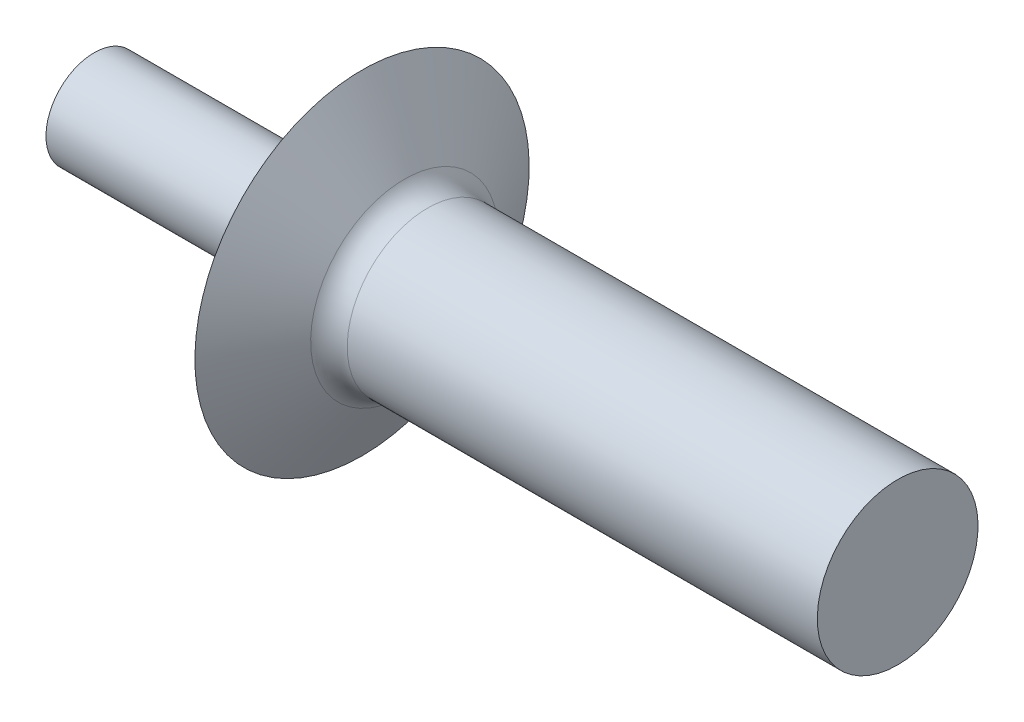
from build123d import *

# Parameters (mm, degrees)
FILLET1_R = 0.5


with BuildPart() as part:
    # Sketch1 → Base-Revolve (revolve)
    with BuildSketch(Plane(origin=(23.915345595, 20.795345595, 0), x_dir=(0, 1, 0), z_dir=(0, 0, 1)), mode=Mode.PRIVATE) as base_revolve_sk:
        Polygon((-20.795345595, 8.915345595), (-19.295345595, 8.915345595), (-19.295345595, 17.980038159), (-17.675345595, 18.915345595), (-19.895345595, 18.915345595), (-19.895345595, 23.915345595), (-20.795345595, 23.915345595), align=None)
    revolve(base_revolve_sk.sketch.rotate(Axis((-27.254202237, 0, 0), (1, 0, 0)), 180), axis=Axis((-27.254202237, 0, 0), (1, 0, 0)))

    # Fillet1
    fillet1_edges = [part.edges().sort_by_distance(p)[0] for p in [
        (5.935307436, 1.5, 0),
    ]]
    fillet(fillet1_edges, radius=FILLET1_R)


solid = part.part
